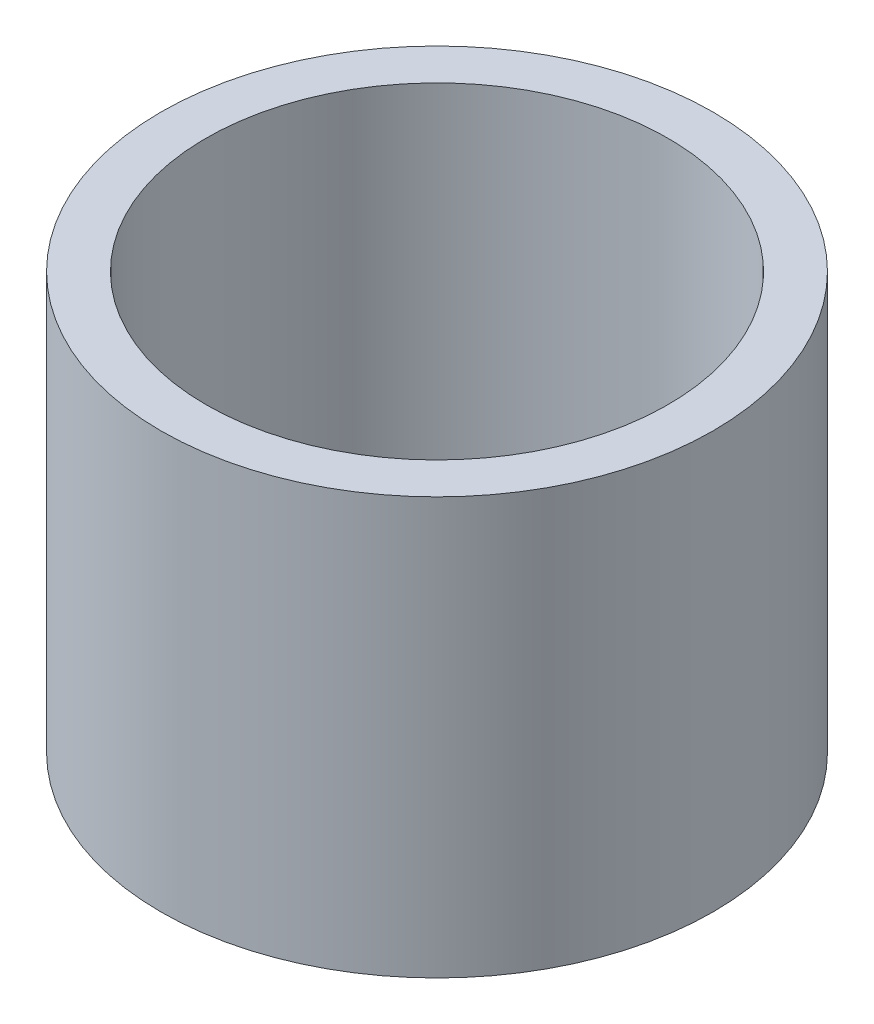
ISO-10303-21;
HEADER;
FILE_DESCRIPTION(('STEP AP214'),'2;1');
FILE_NAME('part.step','',(''),(''),'','','');
FILE_SCHEMA(('AUTOMOTIVE_DESIGN { 1 0 10303 214 1 1 1 1 }'));
ENDSEC;
DATA;
#1=APPLICATION_CONTEXT('core data for automotive mechanical design processes');
#2=APPLICATION_PROTOCOL_DEFINITION('international standard','automotive_design',2000,#1);
#3=PRODUCT_CONTEXT('',#1,'mechanical');
#4=PRODUCT('Part','Part','',(#3));
#5=PRODUCT_RELATED_PRODUCT_CATEGORY('part','',(#4));
#6=PRODUCT_DEFINITION_FORMATION('','',#4);
#7=PRODUCT_DEFINITION_CONTEXT('part definition',#1,'design');
#8=PRODUCT_DEFINITION('design','',#6,#7);
#9=PRODUCT_DEFINITION_SHAPE('','',#8);
#10=(LENGTH_UNIT() NAMED_UNIT(*) SI_UNIT(.MILLI.,.METRE.));
#11=(NAMED_UNIT(*) PLANE_ANGLE_UNIT() SI_UNIT($,.RADIAN.));
#12=(NAMED_UNIT(*) SI_UNIT($,.STERADIAN.) SOLID_ANGLE_UNIT());
#13=UNCERTAINTY_MEASURE_WITH_UNIT(LENGTH_MEASURE(1.E-05),#10,'distance_accuracy_value','');
#14=(GEOMETRIC_REPRESENTATION_CONTEXT(3) GLOBAL_UNCERTAINTY_ASSIGNED_CONTEXT((#13)) GLOBAL_UNIT_ASSIGNED_CONTEXT((#10,
#11,#12)) REPRESENTATION_CONTEXT('',''));
#15=CARTESIAN_POINT('',(0.,0.,0.));
#16=DIRECTION('',(0.,0.,1.));
#17=DIRECTION('',(1.,0.,0.));
#18=AXIS2_PLACEMENT_3D('',#15,#16,#17);
#19=CARTESIAN_POINT('',(0.,83.,0.));
#20=DIRECTION('',(0.,1.,0.));
#21=DIRECTION('',(0.,0.,1.));
#22=AXIS2_PLACEMENT_3D('',#19,#20,#21);
#23=PLANE('',#22);
#24=CARTESIAN_POINT('',(0.,83.,0.));
#25=DIRECTION('',(0.,1.,0.));
#26=DIRECTION('',(0.,0.,1.));
#27=AXIS2_PLACEMENT_3D('',#24,#25,#26);
#28=CIRCLE('',#27,55.);
#29=CARTESIAN_POINT('',(0.,83.,55.));
#30=VERTEX_POINT('',#29);
#31=EDGE_CURVE('E10',#30,#30,#28,.T.);
#32=ORIENTED_EDGE('',*,*,#31,.T.);
#33=EDGE_LOOP('',(#32));
#34=FACE_BOUND('',#33,.T.);
#35=CARTESIAN_POINT('',(0.,83.,0.));
#36=DIRECTION('',(0.,1.,0.));
#37=DIRECTION('',(0.,0.,1.));
#38=AXIS2_PLACEMENT_3D('',#35,#36,#37);
#39=CIRCLE('',#38,46.);
#40=CARTESIAN_POINT('',(0.,83.,46.));
#41=VERTEX_POINT('',#40);
#42=EDGE_CURVE('E38',#41,#41,#39,.T.);
#43=ORIENTED_EDGE('',*,*,#42,.F.);
#44=EDGE_LOOP('',(#43));
#45=FACE_BOUND('',#44,.T.);
#46=ADVANCED_FACE('F27',(#34,#45),#23,.T.);
#47=CARTESIAN_POINT('',(0.,0.,0.));
#48=DIRECTION('',(0.,1.,0.));
#49=DIRECTION('',(0.,0.,1.));
#50=AXIS2_PLACEMENT_3D('',#47,#48,#49);
#51=PLANE('',#50);
#52=CARTESIAN_POINT('',(0.,0.,0.));
#53=DIRECTION('',(0.,1.,0.));
#54=DIRECTION('',(0.,0.,1.));
#55=AXIS2_PLACEMENT_3D('',#52,#53,#54);
#56=CIRCLE('',#55,55.);
#57=CARTESIAN_POINT('',(0.,0.,55.));
#58=VERTEX_POINT('',#57);
#59=EDGE_CURVE('E34',#58,#58,#56,.T.);
#60=ORIENTED_EDGE('',*,*,#59,.F.);
#61=EDGE_LOOP('',(#60));
#62=FACE_BOUND('',#61,.T.);
#63=CARTESIAN_POINT('',(0.,0.,0.));
#64=DIRECTION('',(0.,1.,0.));
#65=DIRECTION('',(0.,0.,1.));
#66=AXIS2_PLACEMENT_3D('',#63,#64,#65);
#67=CIRCLE('',#66,46.);
#68=CARTESIAN_POINT('',(0.,0.,46.));
#69=VERTEX_POINT('',#68);
#70=EDGE_CURVE('E42',#69,#69,#67,.T.);
#71=ORIENTED_EDGE('',*,*,#70,.T.);
#72=EDGE_LOOP('',(#71));
#73=FACE_BOUND('',#72,.T.);
#74=ADVANCED_FACE('F48',(#62,#73),#51,.F.);
#75=CARTESIAN_POINT('',(0.,83.,0.));
#76=DIRECTION('',(0.,-1.,0.));
#77=DIRECTION('',(0.,0.,-1.));
#78=AXIS2_PLACEMENT_3D('',#75,#76,#77);
#79=CYLINDRICAL_SURFACE('',#78,55.);
#80=ORIENTED_EDGE('',*,*,#31,.F.);
#81=EDGE_LOOP('',(#80));
#82=FACE_BOUND('',#81,.T.);
#83=ORIENTED_EDGE('',*,*,#59,.T.);
#84=EDGE_LOOP('',(#83));
#85=FACE_BOUND('',#84,.T.);
#86=ADVANCED_FACE('F29',(#82,#85),#79,.T.);
#87=CARTESIAN_POINT('',(0.,83.,0.));
#88=DIRECTION('',(0.,-1.,0.));
#89=DIRECTION('',(0.,0.,-1.));
#90=AXIS2_PLACEMENT_3D('',#87,#88,#89);
#91=CYLINDRICAL_SURFACE('',#90,46.);
#92=ORIENTED_EDGE('',*,*,#42,.T.);
#93=EDGE_LOOP('',(#92));
#94=FACE_BOUND('',#93,.T.);
#95=ORIENTED_EDGE('',*,*,#70,.F.);
#96=EDGE_LOOP('',(#95));
#97=FACE_BOUND('',#96,.T.);
#98=ADVANCED_FACE('F50',(#94,#97),#91,.F.);
#99=CLOSED_SHELL('',(#46,#74,#86,#98));
#100=MANIFOLD_SOLID_BREP('B2',#99);
#101=ADVANCED_BREP_SHAPE_REPRESENTATION('',(#18,#100),#14);
#102=SHAPE_DEFINITION_REPRESENTATION(#9,#101);
ENDSEC;
END-ISO-10303-21;
